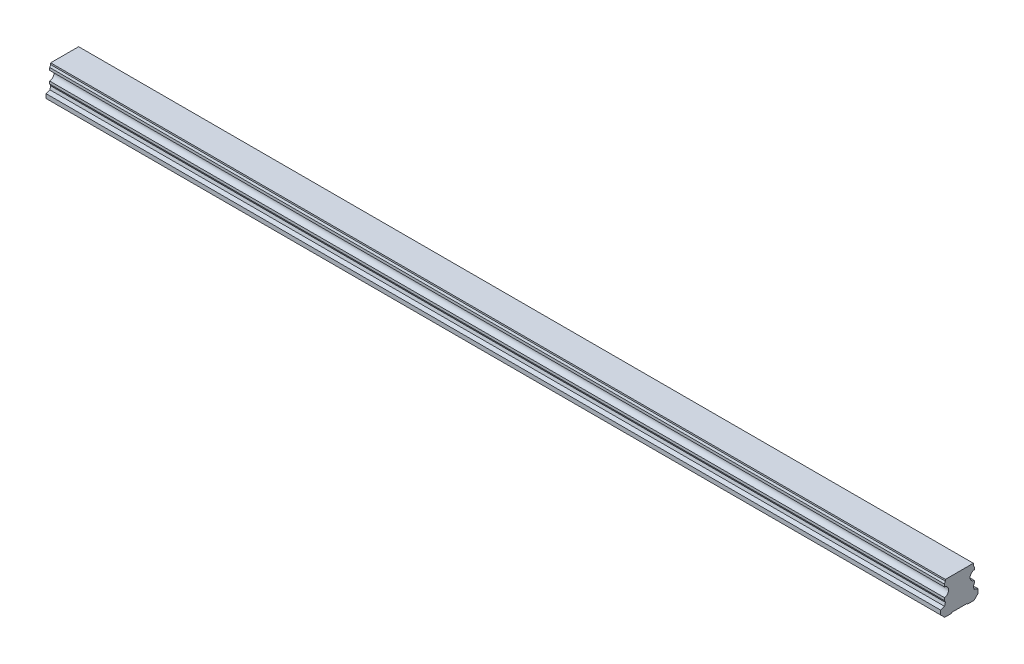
from build123d import *

# Parameters (mm, degrees)
BOSS_EXTRUDE1_DEPTH        = 600
SKETCH3_R                  = 3
SKETCH3_R_2                = 2.5
CUT_EXTRUDE3_DEPTH         = 12
SKETCH3_2_R                = 2.5
CUT_EXTRUDE4_DEPTH         = 15
CHAMFER1_SIZE              = 0.5
LPATTERN4_COUNT            = 10
LPATTERN4_PITCH            = 60
CHAMFER1_OF_LPATTERN4_SIZE = 0.5


with BuildPart() as part:
    # Sketch1 → Boss-Extrude1 (new body)
    with BuildSketch(Plane(origin=(0, 0, 0), x_dir=(0, 0, -1), z_dir=(1, 0, 0))):
        with BuildLine():
            Line((9.375, 21.8), (-9.375, 21.8))
            Line((-9.375, 21.8), (-9.375, 20.756))
            Line((-9.375, 20.756), (-10, 19.415683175))
            Line((-10, 19.415683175), (-10, 17.685449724))
            ThreePointArc((-10, 17.685449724), (-7.2, 14.6), (-10, 11.514550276))
            Line((-10, 11.514550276), (-10, 9.784316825))
            Line((-10, 9.784316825), (-9.375, 8.444))
            Line((-9.375, 8.444), (-9.922688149, 6.4))
            Line((-9.922688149, 6.4), (-12.5, 5.489338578))
            Line((-12.5, 5.489338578), (-12.5, 2.65))
            Line((-12.5, 2.65), (-9.85, 0))
            Line((-9.85, 0), (-5.5, 0))
            Line((-5.5, 0), (-5, 0.5))
            Line((-5, 0.5), (5, 0.5))
            Line((5, 0.5), (5.5, 0))
            Line((5.5, 0), (9.85, 0))
            Line((9.85, 0), (12.5, 2.65))
            Line((12.5, 2.65), (12.5, 5.489338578))
            Line((12.5, 5.489338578), (9.922688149, 6.4))
            Line((9.922688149, 6.4), (9.375, 8.444))
            Line((9.375, 8.444), (10, 9.784316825))
            Line((10, 9.784316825), (10, 11.514550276))
            ThreePointArc((10, 11.514550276), (7.2, 14.6), (10, 17.685449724))
            Line((10, 17.685449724), (10, 19.415683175))
            Line((10, 19.415683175), (9.375, 20.756))
            Line((9.375, 20.756), (9.375, 21.8))
        make_face()
    extrude(amount=BOSS_EXTRUDE1_DEPTH)

    # Sketch3 → Cut-Extrude3 (cut)
    with BuildSketch(Plane.XZ):
        with Locations(Location((30, 0, 0), (0, 0, 270))):
            Circle(SKETCH3_R)
        with Locations(Location((30, 0, 0), (0, 0, 270))):
            Circle(SKETCH3_R_2, mode=Mode.SUBTRACT)
    cut_extrude3 = extrude(amount=-CUT_EXTRUDE3_DEPTH, mode=Mode.SUBTRACT)

    # Sketch3_2 → Cut-Extrude4 (cut)
    with BuildSketch(Plane.XZ):
        with Locations(Location((30, 0, 0), (0, 0, 270))):
            Circle(SKETCH3_2_R)
    cut_extrude4 = extrude(amount=-CUT_EXTRUDE4_DEPTH, mode=Mode.SUBTRACT)

    # Cut-Extrude5 cone 1 section (on through the dimple's axis) → Cut-Extrude5 (revolve, cut)
    with BuildSketch(Plane(origin=(30, 15, 0), x_dir=(0, 0, -1), z_dir=(1, 0, 0))):
        Polygon((0, 0), (2.5, 0), (0, 1.443375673), align=None)
    cut_extrude5 = revolve(axis=Axis((30, 15, 0), (0, 1, 0)), mode=Mode.SUBTRACT)

    # Chamfer1
    chamfer1_edges = [part.edges().sort_by_distance(p)[0] for p in [
        (30, 0.5, 3),
    ]]
    chamfer(chamfer1_edges, length=CHAMFER1_SIZE)

    # LPattern4: Cut-Extrude3, Cut-Extrude4, Cut-Extrude5 ×10
    with Locations(*[(i * LPATTERN4_PITCH, 0, 0) for i in range(1, LPATTERN4_COUNT)]):
        add(cut_extrude3, mode=Mode.SUBTRACT)
        add(cut_extrude4, mode=Mode.SUBTRACT)
        add(cut_extrude5, mode=Mode.SUBTRACT)

    # Chamfer1 of LPattern4
    chamfer1_of_lpattern4_edges = [part.edges().sort_by_distance(p)[0] for p in [
        (90, 0.5, 3),
        (150, 0.5, 3),
        (210, 0.5, 3),
        (270, 0.5, 3),
        (330, 0.5, 3),
        (390, 0.5, 3),
        (450, 0.5, 3),
        (510, 0.5, 3),
        (570, 0.5, 3),
    ]]
    chamfer(chamfer1_of_lpattern4_edges, length=CHAMFER1_OF_LPATTERN4_SIZE)


solid = part.part
